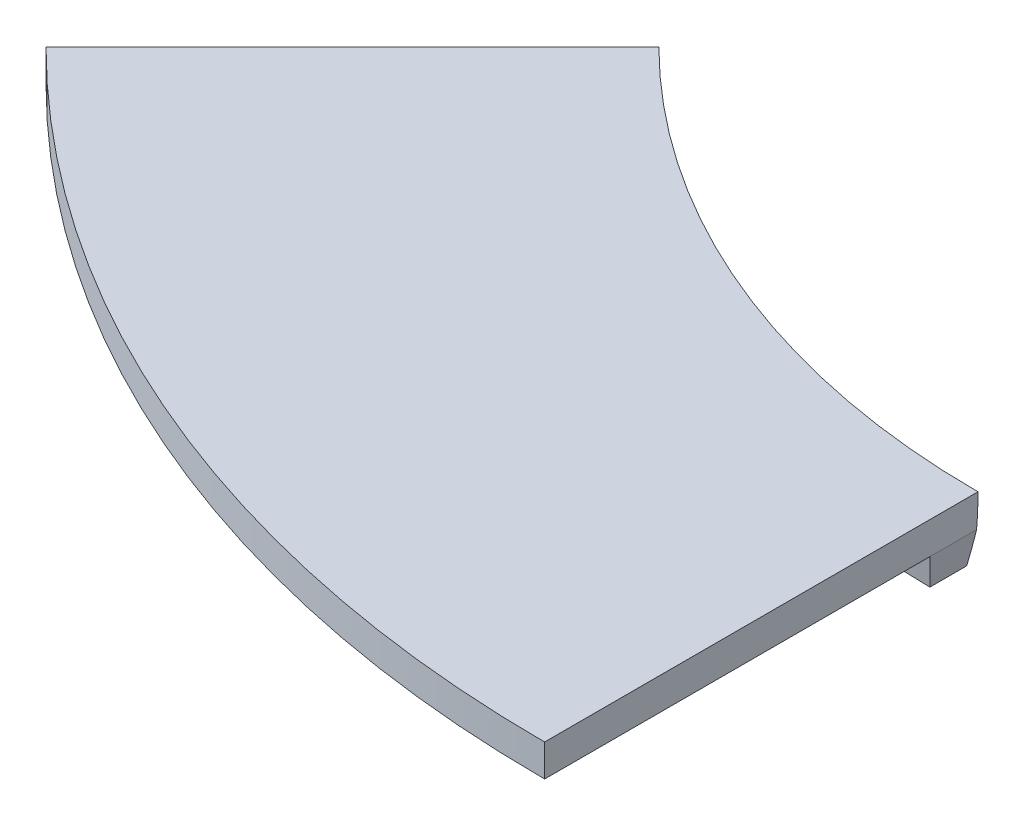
ISO-10303-21;
HEADER;
FILE_DESCRIPTION(('STEP AP214'),'2;1');
FILE_NAME('part.step','',(''),(''),'','','');
FILE_SCHEMA(('AUTOMOTIVE_DESIGN { 1 0 10303 214 1 1 1 1 }'));
ENDSEC;
DATA;
#1=APPLICATION_CONTEXT('core data for automotive mechanical design processes');
#2=APPLICATION_PROTOCOL_DEFINITION('international standard','automotive_design',2000,#1);
#3=PRODUCT_CONTEXT('',#1,'mechanical');
#4=PRODUCT('Part','Part','',(#3));
#5=PRODUCT_RELATED_PRODUCT_CATEGORY('part','',(#4));
#6=PRODUCT_DEFINITION_FORMATION('','',#4);
#7=PRODUCT_DEFINITION_CONTEXT('part definition',#1,'design');
#8=PRODUCT_DEFINITION('design','',#6,#7);
#9=PRODUCT_DEFINITION_SHAPE('','',#8);
#10=(LENGTH_UNIT() NAMED_UNIT(*) SI_UNIT(.MILLI.,.METRE.));
#11=(NAMED_UNIT(*) PLANE_ANGLE_UNIT() SI_UNIT($,.RADIAN.));
#12=(NAMED_UNIT(*) SI_UNIT($,.STERADIAN.) SOLID_ANGLE_UNIT());
#13=UNCERTAINTY_MEASURE_WITH_UNIT(LENGTH_MEASURE(1.E-05),#10,'distance_accuracy_value','');
#14=(GEOMETRIC_REPRESENTATION_CONTEXT(3) GLOBAL_UNCERTAINTY_ASSIGNED_CONTEXT((#13)) GLOBAL_UNIT_ASSIGNED_CONTEXT((#10,
#11,#12)) REPRESENTATION_CONTEXT('',''));
#15=CARTESIAN_POINT('',(0.,0.,0.));
#16=DIRECTION('',(0.,0.,1.));
#17=DIRECTION('',(1.,0.,0.));
#18=AXIS2_PLACEMENT_3D('',#15,#16,#17);
#19=CARTESIAN_POINT('',(0.,99.7370764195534,0.));
#20=DIRECTION('',(0.,1.,0.));
#21=DIRECTION('',(0.,0.,1.));
#22=AXIS2_PLACEMENT_3D('',#19,#20,#21);
#23=TOROIDAL_SURFACE('',#22,3540.,1140.);
#24=CARTESIAN_POINT('',(0.,99.7370764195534,0.));
#25=DIRECTION('',(0.,1.,0.));
#26=DIRECTION('',(0.,0.,1.));
#27=AXIS2_PLACEMENT_3D('',#24,#25,#26);
#28=CIRCLE('',#27,2400.);
#29=CARTESIAN_POINT('',(0.,99.7370764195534,2400.));
#30=VERTEX_POINT('',#29);
#31=CARTESIAN_POINT('',(-1697.05627484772,99.7370764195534,1697.05627484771));
#32=VERTEX_POINT('',#31);
#33=EDGE_CURVE('E209',#30,#32,#28,.F.);
#34=ORIENTED_EDGE('',*,*,#33,.F.);
#35=CARTESIAN_POINT('',(0.,99.7370764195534,3540.));
#36=DIRECTION('',(1.,0.,0.));
#37=DIRECTION('',(0.,0.,-1.));
#38=AXIS2_PLACEMENT_3D('',#35,#36,#37);
#39=CIRCLE('',#38,1140.);
#40=CARTESIAN_POINT('',(0.,0.,2404.37131262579));
#41=VERTEX_POINT('',#40);
#42=EDGE_CURVE('E11',#41,#30,#39,.T.);
#43=ORIENTED_EDGE('',*,*,#42,.F.);
#44=CARTESIAN_POINT('',(-17.3191615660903,-98.2218461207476,2417.25711820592));
#45=CARTESIAN_POINT('',(-16.0216316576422,-90.863188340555,2415.96885237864));
#46=CARTESIAN_POINT('',(-14.7219925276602,-83.4925685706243,2414.75206263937));
#47=CARTESIAN_POINT('',(-12.1189151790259,-68.7297833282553,2412.46171226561));
#48=CARTESIAN_POINT('',(-10.8154769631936,-61.3376178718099,2411.38815152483));
#49=CARTESIAN_POINT('',(-6.9039980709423,-39.1545187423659,2408.38572542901));
#50=CARTESIAN_POINT('',(-4.29090514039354,-24.3349323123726,2406.67125744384));
#51=CARTESIAN_POINT('',(0.944721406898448,5.35778133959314,2403.81683238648));
#52=CARTESIAN_POINT('',(3.5672550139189,20.230908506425,2402.67687472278));
#53=CARTESIAN_POINT('',(7.50707136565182,42.5747173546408,2401.39816739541));
#54=CARTESIAN_POINT('',(8.82233239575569,50.0339333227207,2401.04369975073));
#55=CARTESIAN_POINT('',(11.4537889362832,64.9576649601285,2400.47922433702));
#56=CARTESIAN_POINT('',(12.7699844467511,72.4221806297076,2400.26921657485));
#57=CARTESIAN_POINT('',(14.0864377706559,79.8881584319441,2400.1314746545));
#58=B_SPLINE_CURVE_WITH_KNOTS('',3,(#44,#45,#46,#47,#48,#49,#50,#51,#52,#53,#54,#55,#56,#57),
.UNSPECIFIED.,.F.,.F.,(4,2,2,2,2,2,4),(0.,22.7465595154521,45.4931021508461,90.9180722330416,
136.342995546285,159.089517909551,181.836041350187),.UNSPECIFIED.);
#59=CARTESIAN_POINT('',(-17.3191615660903,-98.2218461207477,2417.25711820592));
#60=VERTEX_POINT('',#59);
#61=EDGE_CURVE('E42',#60,#41,#58,.T.);
#62=ORIENTED_EDGE('',*,*,#61,.F.);
#63=CARTESIAN_POINT('',(0.,-98.2218461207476,0.));
#64=DIRECTION('',(0.,-1.,0.));
#65=DIRECTION('',(0.,0.,-1.));
#66=AXIS2_PLACEMENT_3D('',#63,#64,#65);
#67=CIRCLE('',#66,2417.31916156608);
#68=CARTESIAN_POINT('',(-1697.01240356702,-98.2218461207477,1721.5053967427));
#69=VERTEX_POINT('',#68);
#70=EDGE_CURVE('E219',#69,#60,#67,.F.);
#71=ORIENTED_EDGE('',*,*,#70,.F.);
#72=CARTESIAN_POINT('',(-1700.1472596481,0.,1700.14725964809));
#73=CARTESIAN_POINT('',(-1699.68366852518,-7.40798124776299,1701.53095241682));
#74=CARTESIAN_POINT('',(-1699.27136636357,-14.8097110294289,1702.96437525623));
#75=CARTESIAN_POINT('',(-1698.54950310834,-29.5983249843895,1705.93026004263));
#76=CARTESIAN_POINT('',(-1698.23994204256,-36.9852091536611,1707.46272201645));
#77=CARTESIAN_POINT('',(-1697.46638505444,-59.0980759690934,1712.20331811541));
#78=CARTESIAN_POINT('',(-1697.15613269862,-73.7983725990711,1715.55879063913));
#79=CARTESIAN_POINT('',(-1696.94709001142,-103.107781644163,1722.65845964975));
#80=CARTESIAN_POINT('',(-1697.04830042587,-117.716893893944,1726.40265684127));
#81=CARTESIAN_POINT('',(-1697.50926059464,-139.556054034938,1732.30951750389));
#82=CARTESIAN_POINT('',(-1697.71470650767,-146.828743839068,1734.328510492));
#83=CARTESIAN_POINT('',(-1698.22889213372,-161.343247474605,1738.46209091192));
#84=CARTESIAN_POINT('',(-1698.53763195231,-168.585061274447,1740.57667844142));
#85=CARTESIAN_POINT('',(-1698.89802571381,-175.810262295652,1742.73877728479));
#86=B_SPLINE_CURVE_WITH_KNOTS('',3,(#72,#73,#74,#75,#76,#77,#78,#79,#80,#81,#82,#83,#84,#85),
.UNSPECIFIED.,.F.,.F.,(4,2,2,2,2,2,4),(0.,22.6503554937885,45.300717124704,90.5339117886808,
135.767188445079,158.417585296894,181.068005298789),.UNSPECIFIED.);
#87=CARTESIAN_POINT('',(-1700.1472596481,0.,1700.14725964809));
#88=VERTEX_POINT('',#87);
#89=EDGE_CURVE('E213',#88,#69,#86,.T.);
#90=ORIENTED_EDGE('',*,*,#89,.F.);
#91=CARTESIAN_POINT('',(-2503.15800540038,99.7370764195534,2503.15800540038));
#92=DIRECTION('',(0.707106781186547,0.,0.707106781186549));
#93=DIRECTION('',(0.707106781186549,0.,-0.707106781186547));
#94=AXIS2_PLACEMENT_3D('',#91,#92,#93);
#95=CIRCLE('',#94,1140.);
#96=EDGE_CURVE('E107',#32,#88,#95,.F.);
#97=ORIENTED_EDGE('',*,*,#96,.F.);
#98=EDGE_LOOP('',(#34,#43,#62,#71,#90,#97));
#99=FACE_BOUND('',#98,.T.);
#100=ADVANCED_FACE('F34',(#99),#23,.T.);
#101=CARTESIAN_POINT('',(0.,100.,0.));
#102=DIRECTION('',(0.,-1.,0.));
#103=DIRECTION('',(0.,0.,-1.));
#104=AXIS2_PLACEMENT_3D('',#101,#102,#103);
#105=CYLINDRICAL_SURFACE('',#104,2400.);
#106=DIRECTION('',(0.,-1.,0.));
#107=VECTOR('',#106,1.);
#108=CARTESIAN_POINT('',(0.,100.,2400.));
#109=LINE('',#108,#107);
#110=CARTESIAN_POINT('',(0.,100.,2400.));
#111=VERTEX_POINT('',#110);
#112=EDGE_CURVE('E195',#111,#30,#109,.T.);
#113=ORIENTED_EDGE('',*,*,#112,.T.);
#114=ORIENTED_EDGE('',*,*,#33,.T.);
#115=DIRECTION('',(0.,-1.,0.));
#116=VECTOR('',#115,1.);
#117=CARTESIAN_POINT('',(-1697.05627484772,100.,1697.05627484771));
#118=LINE('',#117,#116);
#119=CARTESIAN_POINT('',(-1697.05627484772,100.,1697.05627484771));
#120=VERTEX_POINT('',#119);
#121=EDGE_CURVE('E207',#120,#32,#118,.T.);
#122=ORIENTED_EDGE('',*,*,#121,.F.);
#123=CARTESIAN_POINT('',(0.,100.,0.));
#124=DIRECTION('',(0.,1.,0.));
#125=DIRECTION('',(0.,0.,1.));
#126=AXIS2_PLACEMENT_3D('',#123,#124,#125);
#127=CIRCLE('',#126,2400.);
#128=EDGE_CURVE('E185',#120,#111,#127,.T.);
#129=ORIENTED_EDGE('',*,*,#128,.T.);
#130=EDGE_LOOP('',(#113,#114,#122,#129));
#131=FACE_BOUND('',#130,.T.);
#132=ADVANCED_FACE('F239',(#131),#105,.F.);
#133=CARTESIAN_POINT('',(0.,100.,0.));
#134=DIRECTION('',(0.707106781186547,0.,0.707106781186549));
#135=DIRECTION('',(0.707106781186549,0.,-0.707106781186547));
#136=AXIS2_PLACEMENT_3D('',#133,#134,#135);
#137=PLANE('',#136);
#138=ORIENTED_EDGE('',*,*,#121,.T.);
#139=ORIENTED_EDGE('',*,*,#96,.T.);
#140=DIRECTION('',(-0.707106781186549,0.,0.707106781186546));
#141=VECTOR('',#140,1.);
#142=CARTESIAN_POINT('',(0.,0.,0.));
#143=LINE('',#142,#141);
#144=CARTESIAN_POINT('',(-1803.1222920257,0.,1803.12229202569));
#145=VERTEX_POINT('',#144);
#146=EDGE_CURVE('E100',#88,#145,#143,.T.);
#147=ORIENTED_EDGE('',*,*,#146,.T.);
#148=CARTESIAN_POINT('',(-2651.65042944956,0.,2651.65042944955));
#149=VERTEX_POINT('',#148);
#150=EDGE_CURVE('E105',#145,#149,#143,.T.);
#151=ORIENTED_EDGE('',*,*,#150,.T.);
#152=DIRECTION('',(0.,-1.,0.));
#153=VECTOR('',#152,1.);
#154=CARTESIAN_POINT('',(-2651.65042944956,100.,2651.65042944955));
#155=LINE('',#154,#153);
#156=CARTESIAN_POINT('',(-2651.65042944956,100.,2651.65042944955));
#157=VERTEX_POINT('',#156);
#158=EDGE_CURVE('E205',#157,#149,#155,.T.);
#159=ORIENTED_EDGE('',*,*,#158,.F.);
#160=DIRECTION('',(-0.707106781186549,0.,0.707106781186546));
#161=VECTOR('',#160,1.);
#162=CARTESIAN_POINT('',(0.,100.,0.));
#163=LINE('',#162,#161);
#164=EDGE_CURVE('E188',#120,#157,#163,.T.);
#165=ORIENTED_EDGE('',*,*,#164,.F.);
#166=EDGE_LOOP('',(#138,#139,#147,#151,#159,#165));
#167=FACE_BOUND('',#166,.T.);
#168=ADVANCED_FACE('F103',(#167),#137,.F.);
#169=CARTESIAN_POINT('',(0.,100.,0.));
#170=DIRECTION('',(0.,-1.,0.));
#171=DIRECTION('',(0.,0.,-1.));
#172=AXIS2_PLACEMENT_3D('',#169,#170,#171);
#173=CYLINDRICAL_SURFACE('',#172,3750.);
#174=CARTESIAN_POINT('',(0.,0.,0.));
#175=DIRECTION('',(0.,1.,0.));
#176=DIRECTION('',(0.,0.,1.));
#177=AXIS2_PLACEMENT_3D('',#174,#175,#176);
#178=CIRCLE('',#177,3750.);
#179=CARTESIAN_POINT('',(0.,0.,3750.));
#180=VERTEX_POINT('',#179);
#181=EDGE_CURVE('E111',#149,#180,#178,.T.);
#182=ORIENTED_EDGE('',*,*,#181,.T.);
#183=DIRECTION('',(0.,-1.,0.));
#184=VECTOR('',#183,1.);
#185=CARTESIAN_POINT('',(0.,100.,3750.));
#186=LINE('',#185,#184);
#187=CARTESIAN_POINT('',(0.,100.,3750.));
#188=VERTEX_POINT('',#187);
#189=EDGE_CURVE('E202',#188,#180,#186,.T.);
#190=ORIENTED_EDGE('',*,*,#189,.F.);
#191=CARTESIAN_POINT('',(0.,100.,0.));
#192=DIRECTION('',(0.,1.,0.));
#193=DIRECTION('',(0.,0.,1.));
#194=AXIS2_PLACEMENT_3D('',#191,#192,#193);
#195=CIRCLE('',#194,3750.);
#196=EDGE_CURVE('E191',#157,#188,#195,.T.);
#197=ORIENTED_EDGE('',*,*,#196,.F.);
#198=ORIENTED_EDGE('',*,*,#158,.T.);
#199=EDGE_LOOP('',(#182,#190,#197,#198));
#200=FACE_BOUND('',#199,.T.);
#201=ADVANCED_FACE('F233',(#200),#173,.T.);
#202=CARTESIAN_POINT('',(0.,100.,0.));
#203=DIRECTION('',(1.,0.,0.));
#204=DIRECTION('',(0.,0.,-1.));
#205=AXIS2_PLACEMENT_3D('',#202,#203,#204);
#206=PLANE('',#205);
#207=DIRECTION('',(0.,0.,1.));
#208=VECTOR('',#207,1.);
#209=CARTESIAN_POINT('',(0.,0.,0.));
#210=LINE('',#209,#208);
#211=CARTESIAN_POINT('',(0.,0.,2550.));
#212=VERTEX_POINT('',#211);
#213=EDGE_CURVE('E189',#41,#212,#210,.T.);
#214=ORIENTED_EDGE('',*,*,#213,.F.);
#215=ORIENTED_EDGE('',*,*,#42,.T.);
#216=ORIENTED_EDGE('',*,*,#112,.F.);
#217=DIRECTION('',(0.,0.,1.));
#218=VECTOR('',#217,1.);
#219=CARTESIAN_POINT('',(0.,100.,0.));
#220=LINE('',#219,#218);
#221=EDGE_CURVE('E193',#111,#188,#220,.T.);
#222=ORIENTED_EDGE('',*,*,#221,.T.);
#223=ORIENTED_EDGE('',*,*,#189,.T.);
#224=EDGE_CURVE('E198',#212,#180,#210,.T.);
#225=ORIENTED_EDGE('',*,*,#224,.F.);
#226=EDGE_LOOP('',(#214,#215,#216,#222,#223,#225));
#227=FACE_BOUND('',#226,.T.);
#228=ADVANCED_FACE('F228',(#227),#206,.T.);
#229=CARTESIAN_POINT('',(0.,100.,0.));
#230=DIRECTION('',(0.,1.,0.));
#231=DIRECTION('',(0.,0.,1.));
#232=AXIS2_PLACEMENT_3D('',#229,#230,#231);
#233=PLANE('',#232);
#234=ORIENTED_EDGE('',*,*,#128,.F.);
#235=ORIENTED_EDGE('',*,*,#164,.T.);
#236=ORIENTED_EDGE('',*,*,#196,.T.);
#237=ORIENTED_EDGE('',*,*,#221,.F.);
#238=EDGE_LOOP('',(#234,#235,#236,#237));
#239=FACE_BOUND('',#238,.T.);
#240=ADVANCED_FACE('F237',(#239),#233,.T.);
#241=CARTESIAN_POINT('',(0.,0.,0.));
#242=DIRECTION('',(0.,1.,0.));
#243=DIRECTION('',(0.,0.,1.));
#244=AXIS2_PLACEMENT_3D('',#241,#242,#243);
#245=PLANE('',#244);
#246=CARTESIAN_POINT('',(0.,0.,0.));
#247=DIRECTION('',(0.,-1.,0.));
#248=DIRECTION('',(0.,0.,-1.));
#249=AXIS2_PLACEMENT_3D('',#246,#247,#248);
#250=CIRCLE('',#249,2550.);
#251=EDGE_CURVE('E118',#212,#145,#250,.T.);
#252=ORIENTED_EDGE('',*,*,#251,.F.);
#253=ORIENTED_EDGE('',*,*,#224,.T.);
#254=ORIENTED_EDGE('',*,*,#181,.F.);
#255=ORIENTED_EDGE('',*,*,#150,.F.);
#256=EDGE_LOOP('',(#252,#253,#254,#255));
#257=FACE_BOUND('',#256,.T.);
#258=ADVANCED_FACE('F116',(#257),#245,.F.);
#259=CARTESIAN_POINT('',(0.,0.,0.));
#260=DIRECTION('',(0.,1.,0.));
#261=DIRECTION('',(0.,0.,-1.));
#262=AXIS2_PLACEMENT_3D('',#259,#260,#261);
#263=CONICAL_SURFACE('',#262,2550.,0.174532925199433);
#264=ORIENTED_EDGE('',*,*,#251,.T.);
#265=CARTESIAN_POINT('',(-1778.14248313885,-100.,1803.07888389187));
#266=CARTESIAN_POINT('',(-1782.31261733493,-83.3350432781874,1803.09337769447));
#267=CARTESIAN_POINT('',(-1786.47933517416,-66.6692315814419,1803.10424194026));
#268=CARTESIAN_POINT('',(-1794.80593813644,-33.3358982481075,1803.1187113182));
#269=CARTESIAN_POINT('',(-1798.96582325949,-16.6683766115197,1803.12231645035));
#270=CARTESIAN_POINT('',(-1803.1222920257,0.,1803.12229202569));
#271=B_SPLINE_CURVE_WITH_KNOTS('',3,(#265,#266,#267,#268,#269,#270),.UNSPECIFIED.,.F.,.F.,(4,2,
4),(0.,51.5363795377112,103.07275904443),.UNSPECIFIED.);
#272=CARTESIAN_POINT('',(-1778.14248313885,-100.,1803.07888389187));
#273=VERTEX_POINT('',#272);
#274=EDGE_CURVE('E121',#273,#145,#271,.T.);
#275=ORIENTED_EDGE('',*,*,#274,.F.);
#276=CARTESIAN_POINT('',(0.,-100.,0.));
#277=DIRECTION('',(0.,-1.,0.));
#278=DIRECTION('',(0.,0.,-1.));
#279=AXIS2_PLACEMENT_3D('',#276,#277,#278);
#280=CIRCLE('',#279,2532.36730192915);
#281=CARTESIAN_POINT('',(-17.6326980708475,-100.,2532.30591355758));
#282=VERTEX_POINT('',#281);
#283=EDGE_CURVE('E135',#282,#273,#280,.T.);
#284=ORIENTED_EDGE('',*,*,#283,.F.);
#285=CARTESIAN_POINT('',(-17.6326980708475,-100.,2532.30591355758));
#286=CARTESIAN_POINT('',(-14.6942165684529,-83.3350432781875,2535.26489239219));
#287=CARTESIAN_POINT('',(-11.7555843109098,-66.6692315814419,2538.21888901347));
#288=CARTESIAN_POINT('',(-5.87801828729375,-33.3358982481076,2544.11691782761));
#289=CARTESIAN_POINT('',(-2.93908452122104,-16.6683766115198,2547.06095002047));
#290=CARTESIAN_POINT('',(0.,0.,2550.));
#291=B_SPLINE_CURVE_WITH_KNOTS('',3,(#285,#286,#287,#288,#289,#290),.UNSPECIFIED.,.F.,.F.,(4,2,
4),(0.,51.5363795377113,103.072759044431),.UNSPECIFIED.);
#292=EDGE_CURVE('E134',#282,#212,#291,.T.);
#293=ORIENTED_EDGE('',*,*,#292,.T.);
#294=EDGE_LOOP('',(#264,#275,#284,#293));
#295=FACE_BOUND('',#294,.T.);
#296=ADVANCED_FACE('F132',(#295),#263,.T.);
#297=CARTESIAN_POINT('',(-1803.1222920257,0.,1803.12229202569));
#298=DIRECTION('',(-0.696364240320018,-0.173648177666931,-0.69636424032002));
#299=DIRECTION('',(-0.707106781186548,0.,0.707106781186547));
#300=AXIS2_PLACEMENT_3D('',#297,#298,#299);
#301=PLANE('',#300);
#302=ORIENTED_EDGE('',*,*,#146,.F.);
#303=ORIENTED_EDGE('',*,*,#89,.T.);
#304=CARTESIAN_POINT('',(-1697.01080662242,-100.,1721.94720737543));
#305=CARTESIAN_POINT('',(-1697.01835790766,-91.6657871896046,1719.87650595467));
#306=CARTESIAN_POINT('',(-1697.02497527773,-83.3317920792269,1717.80492490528));
#307=CARTESIAN_POINT('',(-1697.03633222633,-66.664241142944,1713.65999455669));
#308=CARTESIAN_POINT('',(-1697.04107180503,-58.3306853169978,1711.58664525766));
#309=CARTESIAN_POINT('',(-1697.0486632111,-41.6640152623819,1707.43816902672));
#310=CARTESIAN_POINT('',(-1697.05151503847,-33.3309010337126,1705.36304209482));
#311=CARTESIAN_POINT('',(-1697.0553208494,-16.6651165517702,1701.21100109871));
#312=CARTESIAN_POINT('',(-1697.0562748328,-8.3324462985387,1699.13408703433));
#313=CARTESIAN_POINT('',(-1697.05627484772,-1.55339765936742E-13,1697.05627484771));
#314=B_SPLINE_CURVE_WITH_KNOTS('',3,(#304,#305,#306,#307,#308,#309,#310,#311,#312,#313),
.UNSPECIFIED.,.F.,.F.,(4,2,2,2,4),(0.,25.7628157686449,51.5256291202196,77.2884424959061,
103.051258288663),.UNSPECIFIED.);
#315=CARTESIAN_POINT('',(-1697.01080662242,-100.,1721.94720737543));
#316=VERTEX_POINT('',#315);
#317=EDGE_CURVE('E129',#316,#69,#314,.T.);
#318=ORIENTED_EDGE('',*,*,#317,.F.);
#319=DIRECTION('',(-0.707106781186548,0.,0.707106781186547));
#320=VECTOR('',#319,1.);
#321=CARTESIAN_POINT('',(-1790.65409164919,-100.,1815.5904924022));
#322=LINE('',#321,#320);
#323=EDGE_CURVE('E125',#273,#316,#322,.F.);
#324=ORIENTED_EDGE('',*,*,#323,.F.);
#325=ORIENTED_EDGE('',*,*,#274,.T.);
#326=EDGE_LOOP('',(#302,#303,#318,#324,#325));
#327=FACE_BOUND('',#326,.T.);
#328=ADVANCED_FACE('F123',(#327),#301,.T.);
#329=CARTESIAN_POINT('',(0.,0.,0.));
#330=DIRECTION('',(0.,-1.,0.));
#331=DIRECTION('',(0.,0.,-1.));
#332=AXIS2_PLACEMENT_3D('',#329,#330,#331);
#333=CONICAL_SURFACE('',#332,2400.,0.174532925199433);
#334=ORIENTED_EDGE('',*,*,#317,.T.);
#335=ORIENTED_EDGE('',*,*,#70,.T.);
#336=CARTESIAN_POINT('',(-17.6326980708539,-100.,2417.56839628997));
#337=CARTESIAN_POINT('',(-16.1631514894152,-91.6657871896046,2416.10952883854));
#338=CARTESIAN_POINT('',(-14.6936432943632,-83.3317920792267,2414.64937901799));
#339=CARTESIAN_POINT('',(-11.7547043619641,-66.6642411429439,2411.72650123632));
#340=CARTESIAN_POINT('',(-10.2852736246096,-58.3306853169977,2410.26377327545));
#341=CARTESIAN_POINT('',(-7.34649001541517,-41.6640152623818,2407.33572553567));
#342=CARTESIAN_POINT('',(-5.87713714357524,-33.3309010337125,2405.87040575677));
#343=CARTESIAN_POINT('',(-2.93850968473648,-16.6651165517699,2402.93716052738));
#344=CARTESIAN_POINT('',(-1.46923509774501,-8.33244629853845,2401.46923507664));
#345=CARTESIAN_POINT('',(-8.37103518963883E-12,0.,2400.));
#346=B_SPLINE_CURVE_WITH_KNOTS('',3,(#336,#337,#338,#339,#340,#341,#342,#343,#344,#345),
.UNSPECIFIED.,.F.,.F.,(4,2,2,2,4),(0.,25.7628157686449,51.5256291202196,77.2884424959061,
103.051258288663),.UNSPECIFIED.);
#347=CARTESIAN_POINT('',(-17.6326980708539,-100.,2417.56839628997));
#348=VERTEX_POINT('',#347);
#349=EDGE_CURVE('E167',#348,#60,#346,.T.);
#350=ORIENTED_EDGE('',*,*,#349,.F.);
#351=CARTESIAN_POINT('',(0.,-100.,0.));
#352=DIRECTION('',(0.,-1.,0.));
#353=DIRECTION('',(0.,0.,-1.));
#354=AXIS2_PLACEMENT_3D('',#351,#352,#353);
#355=CIRCLE('',#354,2417.63269807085);
#356=EDGE_CURVE('E181',#316,#348,#355,.F.);
#357=ORIENTED_EDGE('',*,*,#356,.F.);
#358=EDGE_LOOP('',(#334,#335,#350,#357));
#359=FACE_BOUND('',#358,.T.);
#360=ADVANCED_FACE('F161',(#359),#333,.F.);
#361=CARTESIAN_POINT('',(0.,0.,2550.));
#362=DIRECTION('',(0.984807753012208,-0.173648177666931,0.));
#363=DIRECTION('',(0.173648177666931,0.984807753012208,0.));
#364=AXIS2_PLACEMENT_3D('',#361,#362,#363);
#365=PLANE('',#364);
#366=ORIENTED_EDGE('',*,*,#349,.T.);
#367=ORIENTED_EDGE('',*,*,#61,.T.);
#368=ORIENTED_EDGE('',*,*,#213,.T.);
#369=ORIENTED_EDGE('',*,*,#292,.F.);
#370=DIRECTION('',(0.,0.,-1.));
#371=VECTOR('',#370,1.);
#372=CARTESIAN_POINT('',(-17.6326980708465,-100.,2550.));
#373=LINE('',#372,#371);
#374=EDGE_CURVE('E183',#348,#282,#373,.F.);
#375=ORIENTED_EDGE('',*,*,#374,.F.);
#376=EDGE_LOOP('',(#366,#367,#368,#369,#375));
#377=FACE_BOUND('',#376,.T.);
#378=ADVANCED_FACE('F155',(#377),#365,.T.);
#379=CARTESIAN_POINT('',(0.,-100.,0.));
#380=DIRECTION('',(0.,-1.,0.));
#381=DIRECTION('',(0.,0.,-1.));
#382=AXIS2_PLACEMENT_3D('',#379,#380,#381);
#383=PLANE('',#382);
#384=ORIENTED_EDGE('',*,*,#283,.T.);
#385=ORIENTED_EDGE('',*,*,#323,.T.);
#386=ORIENTED_EDGE('',*,*,#356,.T.);
#387=ORIENTED_EDGE('',*,*,#374,.T.);
#388=EDGE_LOOP('',(#384,#385,#386,#387));
#389=FACE_BOUND('',#388,.T.);
#390=ADVANCED_FACE('F160',(#389),#383,.T.);
#391=CLOSED_SHELL('',(#100,#132,#168,#201,#228,#240,#258,#296,#328,#360,#378,#390));
#392=MANIFOLD_SOLID_BREP('B2',#391);
#393=ADVANCED_BREP_SHAPE_REPRESENTATION('',(#18,#392),#14);
#394=SHAPE_DEFINITION_REPRESENTATION(#9,#393);
ENDSEC;
END-ISO-10303-21;
